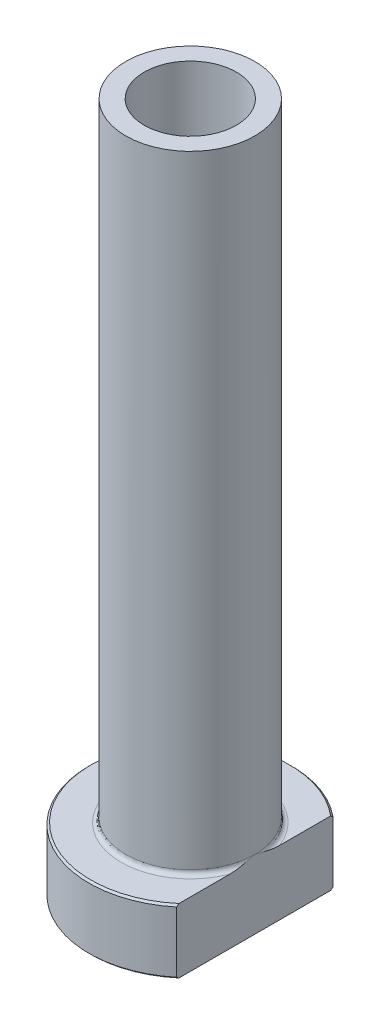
from build123d import *

# Parameters (mm, degrees)
FILLET1_R          = 0.5
CHAMFER1_SIZE      = 0.2
CUT_EXTRUDE1_DEPTH = 77.59634456
CHAMFER2_SIZE      = 0.5


with BuildPart() as part:
    # Sketch1 → Revolve1 (revolve)
    with BuildSketch(Plane.XY, mode=Mode.PRIVATE) as revolve1_sk:
        Polygon((-5, 75), (-7, 75), (-7, 7), (-11, 7), (-11, 0), (-5.25, 0), (-5.25, 18), (-5, 30), align=None)
    revolve(revolve1_sk.sketch.rotate(Axis((0, 92.187680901, 0), (0, -1, 0)), 270), axis=Axis((0, 92.187680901, 0), (0, -1, 0)))

    # Fillet1
    fillet1_edges = [part.edges().sort_by_distance(p)[0] for p in [
        (0, 7, -7),
    ]]
    fillet(fillet1_edges, radius=FILLET1_R)

    # Chamfer1
    chamfer1_edges = [part.edges().sort_by_distance(p)[0] for p in [
        (0, 0, -11),
        (0, 7, -11),
    ]]
    chamfer(chamfer1_edges, length=CHAMFER1_SIZE)

    # Sketch2 → Cut-Extrude1 (cut, through all)
    with BuildSketch(Plane.XZ):
        with BuildLine():
            Line((7, 8.485281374), (7, -8.485281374))
            ThreePointArc((7, -8.485281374), (11, 0), (7, 8.485281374))
        make_face()
    extrude(amount=-CUT_EXTRUDE1_DEPTH, mode=Mode.SUBTRACT)

    # Chamfer2
    chamfer2_edges = [part.edges().sort_by_distance(p)[0] for p in [
        (0, 0, -5.25),
    ]]
    chamfer(chamfer2_edges, length=CHAMFER2_SIZE)


solid = part.part
